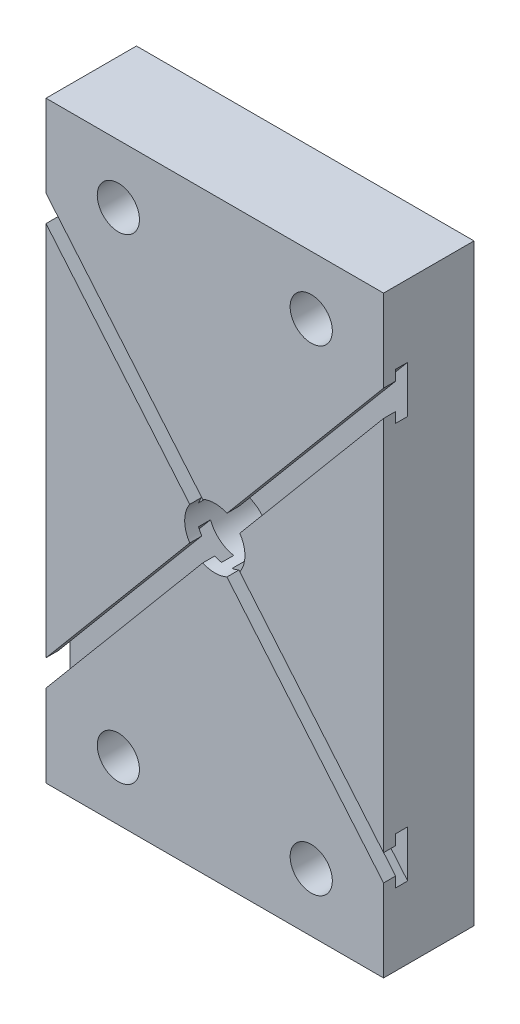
from build123d import *
from build123d.topology import SkipClean

# Parameters (mm, degrees)
SKETCH_1_W                  = 280
SKETCH_1_H                  = 492
SKETCH_1_R                  = 17.5
SKETCH_1_R_2                = 25
EXTRUDE_1_DEPTH             = 75
SKETCH_2_W                  = 250
SKETCH_2_H                  = 468
CUT_EXTRUDE_1_DEPTH         = 50
EXTRUDE_START               = 40
SKETCH_3_R                  = 50
SKETCH_3_R_2                = 25
EXTRUDE_2_DEPTH             = 40
EXTRUDE_5_DEPTH             = 7.5
EXTRUDE_5_DEPTH_BACK        = 7.5
EXTRUDE_5_2_DEPTH           = 7.5
EXTRUDE_5_2_DEPTH_BACK      = 7.5
SKETCH_5_W                  = 15
SKETCH_5_H                  = 40
EXTRUDE_8_DEPTH             = 0.5657
SKETCH_7_W                  = 15
SKETCH_7_H                  = 40
EXTRUDE_9_DEPTH             = 0.5657
EXTRUDE_10_DEPTH            = 7.5
EXTRUDE_10_DEPTH_BACK       = 7.5
EXTRUDE_10_2_DEPTH          = 7.5
EXTRUDE_10_2_DEPTH_BACK     = 7.5
SKETCH_9_W                  = 40
SKETCH_9_H                  = 15
EXTRUDE_12_DEPTH            = 0.5657
SKETCH_12_W                 = 40
SKETCH_12_H                 = 15
EXTRUDE_13_DEPTH            = 0.5657
EXTRUDE_14_DEPTH            = 20
EXTRUDE_14_2_DEPTH          = 20
EXTRUDE_14_3_DEPTH          = 20
EXTRUDE_14_4_DEPTH          = 20
EXTRUDE_16_DEPTH            = 20
EXTRUDE_16_2_DEPTH          = 20
EXTRUDE_16_3_DEPTH          = 20
EXTRUDE_16_4_DEPTH          = 20
CUT_EXTRUDE_3_DEPTH         = 291.415219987
CUT_EXTRUDE_3_DEPTH_BACK    = 291.415219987
CUT_EXTRUDE_4_DEPTH         = 291.415219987
CUT_EXTRUDE_4_DEPTH_BACK    = 291.415219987
HOLE_WIZARD_M8_3_AT_2_COUNT = 2
HOLE_WIZARD_M8_3_AT_2_PITCH = 264
HOLE_WIZARD_M8_3_AT_3_COUNT = 2
HOLE_WIZARD_M8_3_AT_3_PITCH = 475
HOLE_WIZARD_M8_3_AT_4_COUNT = 2
HOLE_WIZARD_M8_3_AT_4_PITCH = 543.434448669


with BuildPart() as part:
    # Sketch 1 → Extrude 1 (new body)
    with BuildSketch(Plane.XY):
        Rectangle(SKETCH_1_W, SKETCH_1_H)
        with Locations((80, -197.5)):
            Circle(SKETCH_1_R, mode=Mode.SUBTRACT)
        with Locations(Location((80, 197.5, 0), (0, 0, 180))):
            Circle(SKETCH_1_R, mode=Mode.SUBTRACT)
        with Locations(Location((-80, -197.5, 0), (0, 0, 180))):
            Circle(SKETCH_1_R, mode=Mode.SUBTRACT)
        with Locations((-80, 197.5)):
            Circle(SKETCH_1_R, mode=Mode.SUBTRACT)
        Circle(SKETCH_1_R_2, mode=Mode.SUBTRACT)
    extrude(amount=EXTRUDE_1_DEPTH)

    # Sketch 2 → Cut-Extrude 1 (cut)
    with BuildSketch(Plane(origin=(0, 0, 0), x_dir=(-1, 0, 0), z_dir=(0, 0, -1))):
        Rectangle(SKETCH_2_W, SKETCH_2_H)
    extrude(amount=-CUT_EXTRUDE_1_DEPTH, mode=Mode.SUBTRACT)

    # Sketch 3 → Extrude 2 (add)
    with SkipClean():  # the faces are left unmerged after this step: merging them gives an invalid solid
        with BuildSketch(Plane(origin=(0, 0, 50), x_dir=(-1, 0, 0), z_dir=(0, 0, -1)).offset(EXTRUDE_START)):
            Circle(SKETCH_3_R)
            Circle(SKETCH_3_R_2, mode=Mode.SUBTRACT)
        extrude(amount=-EXTRUDE_2_DEPTH)



with BuildPart() as body_2:
    # Sketch 4 → Extrude 5 (new, two sides: drawn at the far end of the back side and taken through both)
    with BuildSketch(Plane(origin=(0, 0, 0), x_dir=(0, 0, -1), z_dir=(1, 0, 0)).offset(-EXTRUDE_5_DEPTH_BACK)):
        Polygon((-50, -50), (-50, -234), (-30, -234), (-10, -50), align=None)
    extrude(amount=EXTRUDE_5_DEPTH + EXTRUDE_5_DEPTH_BACK)


with BuildPart() as body_3:
    # Sketch 4 → Extrude 5 2 (new, two sides: drawn at the far end of the back side and taken through both)
    with BuildSketch(Plane(origin=(0, 0, 0), x_dir=(0, 0, -1), z_dir=(1, 0, 0)).offset(-EXTRUDE_5_2_DEPTH_BACK)):
        Polygon((-30, 234), (-50, 234), (-50, 50), (-10, 50), align=None)
    extrude(amount=EXTRUDE_5_2_DEPTH + EXTRUDE_5_2_DEPTH_BACK)


with BuildPart() as part_1:
    with SkipClean():  # the faces are left unmerged after this step: merging them gives an invalid solid
        add(part.part)

        add(body_2.part)  # Extrude 8 merges body 2
        # Sketch 5 → Extrude 8 (add)
        with BuildSketch(Plane(origin=(0, -50, 0), x_dir=(1, 0, 0), z_dir=(0, 1, 0))):
            with Locations((0, -30)):
                Rectangle(SKETCH_5_W, SKETCH_5_H)
        extrude(amount=EXTRUDE_8_DEPTH)


    with SkipClean():  # the faces are left unmerged after this step: merging them gives an invalid solid
        add(body_3.part)  # Extrude 9 merges body 3
        # Sketch 7 → Extrude 9 (add)
        with BuildSketch(Plane.XZ.offset(-50)):
            with Locations((0, 30)):
                Rectangle(SKETCH_7_W, SKETCH_7_H)
        extrude(amount=EXTRUDE_9_DEPTH)



with BuildPart() as body_2_2:
    # Sketch 8 → Extrude 10 (new, two sides: drawn at the far end of the back side and taken through both)
    with BuildSketch(Plane(origin=(0, 0, 0), x_dir=(1, 0, 0), z_dir=(0, 1, 0)).offset(-EXTRUDE_10_DEPTH_BACK)):
        Polygon((125, -50), (50, -50), (50, -10), (125, -30), align=None)
    extrude(amount=EXTRUDE_10_DEPTH + EXTRUDE_10_DEPTH_BACK)


with BuildPart() as body_3_2:
    # Sketch 8 → Extrude 10 2 (new, two sides: drawn at the far end of the back side and taken through both)
    with BuildSketch(Plane(origin=(0, 0, 0), x_dir=(1, 0, 0), z_dir=(0, 1, 0)).offset(-EXTRUDE_10_2_DEPTH_BACK)):
        Polygon((-50, -50), (-125, -50), (-125, -30), (-50, -10), align=None)
    extrude(amount=EXTRUDE_10_2_DEPTH + EXTRUDE_10_2_DEPTH_BACK)


with BuildPart() as part_2:
    with SkipClean():  # the faces are left unmerged after this step: merging them gives an invalid solid
        add(part_1.part)

        add(body_3_2.part)  # Extrude 12 merges body 3 2
        # Sketch 9 → Extrude 12 (add)
        with BuildSketch(Plane(origin=(-50, 0, 0), x_dir=(0, 0, -1), z_dir=(1, 0, 0))):
            with Locations((-30, 0)):
                Rectangle(SKETCH_9_W, SKETCH_9_H)
        extrude(amount=EXTRUDE_12_DEPTH)


    with SkipClean():  # the faces are left unmerged after this step: merging them gives an invalid solid
        add(body_2_2.part)  # Extrude 13 merges body 2 2
        # Sketch 12 → Extrude 13 (add)
        with BuildSketch(Plane.ZY.offset(-50)):
            with Locations((30, 0)):
                Rectangle(SKETCH_12_W, SKETCH_12_H)
        extrude(amount=EXTRUDE_13_DEPTH)

    # Sketch 17 → Cut-Extrude 3 (cut, two sides: drawn at the far end of the back side and taken through both)
    with SkipClean():  # the faces are left unmerged after this step: merging them gives an invalid solid
        with BuildSketch(Plane(origin=(0, 0, 10), x_dir=(-0.7660444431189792, 0.6427876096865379, -1.8719702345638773e-15), z_dir=(-0.6427876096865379, -0.7660444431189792, 2.2309272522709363e-15)).offset(-CUT_EXTRUDE_3_DEPTH_BACK)):
            Polygon((7, -65), (-7, -65), (-7, -55), (-12.5, -55), (-12.5, -45), (12.5, -45), (12.5, -55), (7, -55), align=None)
        extrude(amount=CUT_EXTRUDE_3_DEPTH + CUT_EXTRUDE_3_DEPTH_BACK, mode=Mode.SUBTRACT)

    # Sketch 18 → Cut-Extrude 4 (cut, two sides: drawn at the far end of the back side and taken through both)
    with SkipClean():  # the faces are left unmerged after this step: merging them gives an invalid solid
        with BuildSketch(Plane(origin=(0, 0, 10), x_dir=(-0.7660444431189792, -0.6427876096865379, -1.8719702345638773e-15), z_dir=(0.6427876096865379, -0.7660444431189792, -2.2309272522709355e-15)).offset(-CUT_EXTRUDE_4_DEPTH_BACK)):
            Polygon((7, -65), (-7, -65), (-7, -55), (-12.5, -55), (-12.5, -45), (12.5, -45), (12.5, -55), (7, -55), align=None)
        extrude(amount=CUT_EXTRUDE_4_DEPTH + CUT_EXTRUDE_4_DEPTH_BACK, mode=Mode.SUBTRACT)

    # Sketch 25 → Hole Wizard M8 _3 (revolve, cut)
    with SkipClean():  # the faces are left unmerged after this step: merging them gives an invalid solid
        with BuildSketch(Plane(origin=(-132, -237.5, 0), x_dir=(0, 1, 0), z_dir=(1, 0, 0))):
            Polygon((0, 0), (0, 25.792926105), (3.4, 23.75), (3.4, 0), align=None)
        hole_wizard_m8_3 = revolve(axis=Axis((-132, -237.5, -6.35), (0, 0, 1)), mode=Mode.SUBTRACT)

    # Hole Wizard M8 _3 at 2: Hole Wizard M8 _3 ×2
    with SkipClean():  # the faces are left unmerged after this step: merging them gives an invalid solid
        with Locations(*[(i * HOLE_WIZARD_M8_3_AT_2_PITCH, 0, 0) for i in range(1, HOLE_WIZARD_M8_3_AT_2_COUNT)]):
            add(hole_wizard_m8_3, mode=Mode.SUBTRACT)

    # Hole Wizard M8 _3 at 3: Hole Wizard M8 _3 ×2
    with SkipClean():  # the faces are left unmerged after this step: merging them gives an invalid solid
        with Locations(*[(0, i * HOLE_WIZARD_M8_3_AT_3_PITCH, 0) for i in range(1, HOLE_WIZARD_M8_3_AT_3_COUNT)]):
            add(hole_wizard_m8_3, mode=Mode.SUBTRACT)

    # Hole Wizard M8 _3 at 4: Hole Wizard M8 _3 ×2
    with SkipClean():  # the faces are left unmerged after this step: merging them gives an invalid solid
        with Locations(*[Vector(0.48579916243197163, 0.8740704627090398, 0) * (i * HOLE_WIZARD_M8_3_AT_4_PITCH) for i in range(1, HOLE_WIZARD_M8_3_AT_4_COUNT)]):
            add(hole_wizard_m8_3, mode=Mode.SUBTRACT)


with BuildPart() as body_2_3:
    # Sketch 13 → Extrude 14 (new body)
    with BuildSketch(Plane(origin=(0, 0, 50), x_dir=(-1, 0, 0), z_dir=(0, 0, -1))):
        with BuildLine():
            Line((125, 121.744032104), (43.512332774, 24.630811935))
            ThreePointArc((43.512332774, 24.630811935), (32.139380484, 38.302222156), (16.700777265, 47.128378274))
            Line((16.700777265, 47.128378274), (125, 176.194366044))
            Line((125, 176.194366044), (125, 121.744032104))
        make_face()
    extrude(amount=EXTRUDE_14_DEPTH)


with BuildPart() as body_3_3:
    # Sketch 13 → Extrude 14 2 (new body)
    with BuildSketch(Plane(origin=(0, 0, 50), x_dir=(-1, 0, 0), z_dir=(0, 0, -1))):
        with BuildLine():
            Line((-125, 176.194366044), (-125, 121.744032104))
            Line((-125, 121.744032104), (-43.512332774, 24.630811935))
            ThreePointArc((-43.512332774, 24.630811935), (-32.139380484, 38.302222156), (-16.700777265, 47.128378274))
            Line((-16.700777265, 47.128378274), (-125, 176.194366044))
        make_face()
    extrude(amount=EXTRUDE_14_2_DEPTH)


with BuildPart() as body_4:
    # Sketch 13 → Extrude 14 3 (new body)
    with BuildSketch(Plane(origin=(0, 0, 50), x_dir=(-1, 0, 0), z_dir=(0, 0, -1))):
        with BuildLine():
            Line((125, -176.194366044), (125, -121.744032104))
            Line((125, -121.744032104), (43.512332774, -24.630811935))
            ThreePointArc((43.512332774, -24.630811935), (32.139380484, -38.302222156), (16.700777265, -47.128378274))
            Line((16.700777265, -47.128378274), (125, -176.194366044))
        make_face()
    extrude(amount=EXTRUDE_14_3_DEPTH)


with BuildPart() as body_5:
    # Sketch 13 → Extrude 14 4 (new body)
    with BuildSketch(Plane(origin=(0, 0, 50), x_dir=(-1, 0, 0), z_dir=(0, 0, -1))):
        with BuildLine():
            Line((-16.700777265, -47.128378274), (-125, -176.194366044))
            Line((-125, -176.194366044), (-125, -121.744032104))
            Line((-125, -121.744032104), (-43.512332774, -24.630811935))
            ThreePointArc((-43.512332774, -24.630811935), (-32.139380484, -38.302222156), (-16.700777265, -47.128378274))
        make_face()
    extrude(amount=EXTRUDE_14_4_DEPTH)


with BuildPart() as body_6:
    # Sketch 14 → Extrude 16 (new body)
    with BuildSketch(Plane(origin=(0, 0, 50), x_dir=(-1, 0, 0), z_dir=(0, 0, -1))):
        Polygon((88.336073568, -132.5), (7.5, -132.5), (7.5, -117.5), (75.7495791, -117.5), align=None)
    extrude(amount=EXTRUDE_16_DEPTH)


with BuildPart() as body_7:
    # Sketch 14 → Extrude 16 2 (new body)
    with BuildSketch(Plane(origin=(0, 0, 50), x_dir=(-1, 0, 0), z_dir=(0, 0, -1))):
        Polygon((-7.5, 117.5), (-75.7495791, 117.5), (-88.336073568, 132.5), (-7.5, 132.5), align=None)
    extrude(amount=EXTRUDE_16_2_DEPTH)


with BuildPart() as body_8:
    # Sketch 14 → Extrude 16 3 (new body)
    with BuildSketch(Plane(origin=(0, 0, 50), x_dir=(-1, 0, 0), z_dir=(0, 0, -1))):
        Polygon((75.7495791, 117.5), (7.5, 117.5), (7.5, 132.5), (88.336073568, 132.5), align=None)
    extrude(amount=EXTRUDE_16_3_DEPTH)


with BuildPart() as body_9:
    # Sketch 14 → Extrude 16 4 (new body)
    with BuildSketch(Plane(origin=(0, 0, 50), x_dir=(-1, 0, 0), z_dir=(0, 0, -1))):
        Polygon((-7.5, -117.5), (-75.7495791, -117.5), (-88.336073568, -132.5), (-7.5, -132.5), align=None)
    extrude(amount=EXTRUDE_16_4_DEPTH)


solid = Compound([part_2.part, body_2_3.part, body_3_3.part, body_4.part, body_5.part, body_6.part, body_7.part, body_8.part, body_9.part])
